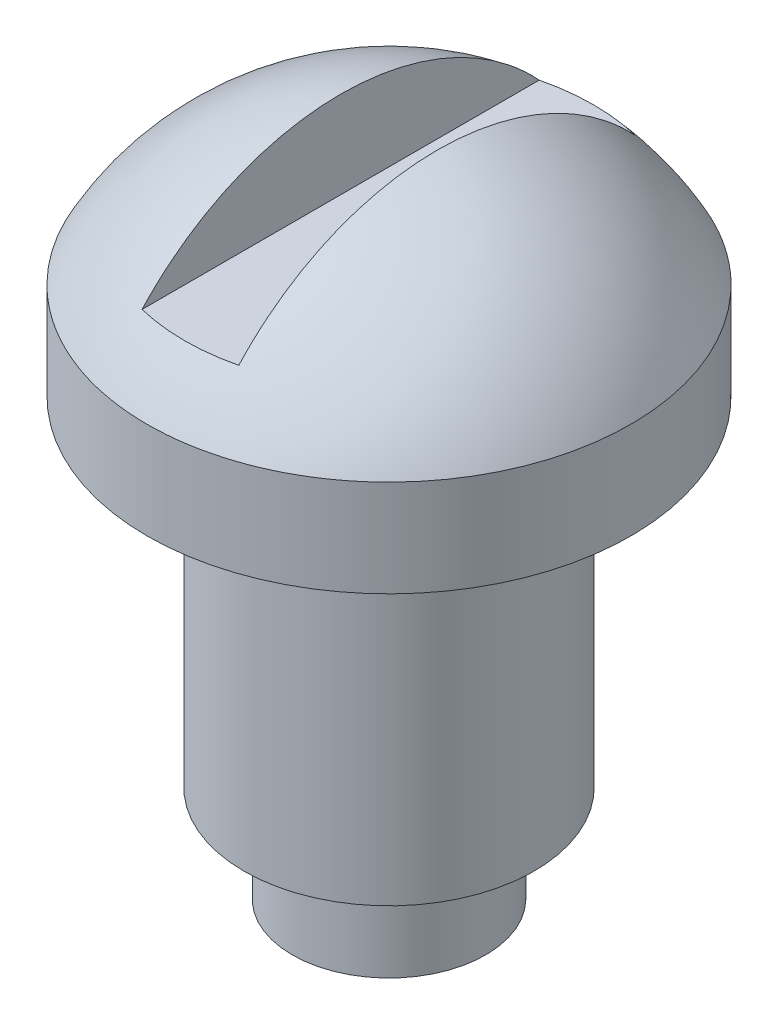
ISO-10303-21;
HEADER;
FILE_DESCRIPTION(('STEP AP214'),'2;1');
FILE_NAME('part.step','',(''),(''),'','','');
FILE_SCHEMA(('AUTOMOTIVE_DESIGN { 1 0 10303 214 1 1 1 1 }'));
ENDSEC;
DATA;
#1=APPLICATION_CONTEXT('core data for automotive mechanical design processes');
#2=APPLICATION_PROTOCOL_DEFINITION('international standard','automotive_design',2000,#1);
#3=PRODUCT_CONTEXT('',#1,'mechanical');
#4=PRODUCT('Part','Part','',(#3));
#5=PRODUCT_RELATED_PRODUCT_CATEGORY('part','',(#4));
#6=PRODUCT_DEFINITION_FORMATION('','',#4);
#7=PRODUCT_DEFINITION_CONTEXT('part definition',#1,'design');
#8=PRODUCT_DEFINITION('design','',#6,#7);
#9=PRODUCT_DEFINITION_SHAPE('','',#8);
#10=(LENGTH_UNIT() NAMED_UNIT(*) SI_UNIT(.MILLI.,.METRE.));
#11=(NAMED_UNIT(*) PLANE_ANGLE_UNIT() SI_UNIT($,.RADIAN.));
#12=(NAMED_UNIT(*) SI_UNIT($,.STERADIAN.) SOLID_ANGLE_UNIT());
#13=UNCERTAINTY_MEASURE_WITH_UNIT(LENGTH_MEASURE(1.E-05),#10,'distance_accuracy_value','');
#14=(GEOMETRIC_REPRESENTATION_CONTEXT(3) GLOBAL_UNCERTAINTY_ASSIGNED_CONTEXT((#13)) GLOBAL_UNIT_ASSIGNED_CONTEXT((#10,
#11,#12)) REPRESENTATION_CONTEXT('',''));
#15=CARTESIAN_POINT('',(0.,0.,0.));
#16=DIRECTION('',(0.,0.,1.));
#17=DIRECTION('',(1.,0.,0.));
#18=AXIS2_PLACEMENT_3D('',#15,#16,#17);
#19=CARTESIAN_POINT('',(0.,0.,0.));
#20=DIRECTION('',(0.,1.,0.));
#21=DIRECTION('',(0.,0.,1.));
#22=AXIS2_PLACEMENT_3D('',#19,#20,#21);
#23=PLANE('',#22);
#24=CARTESIAN_POINT('',(0.,0.,0.));
#25=DIRECTION('',(0.,1.,0.));
#26=DIRECTION('',(0.,0.,1.));
#27=AXIS2_PLACEMENT_3D('',#24,#25,#26);
#28=CIRCLE('',#27,2.);
#29=CARTESIAN_POINT('',(0.,0.,2.));
#30=VERTEX_POINT('',#29);
#31=EDGE_CURVE('E64',#30,#30,#28,.T.);
#32=ORIENTED_EDGE('',*,*,#31,.F.);
#33=EDGE_LOOP('',(#32));
#34=FACE_BOUND('',#33,.T.);
#35=ADVANCED_FACE('F32',(#34),#23,.F.);
#36=CARTESIAN_POINT('',(0.,0.,0.));
#37=DIRECTION('',(0.,1.,0.));
#38=DIRECTION('',(0.,0.,1.));
#39=AXIS2_PLACEMENT_3D('',#36,#37,#38);
#40=CYLINDRICAL_SURFACE('',#39,2.);
#41=CARTESIAN_POINT('',(0.,2.,0.));
#42=DIRECTION('',(0.,1.,0.));
#43=DIRECTION('',(0.,0.,1.));
#44=AXIS2_PLACEMENT_3D('',#41,#42,#43);
#45=CIRCLE('',#44,2.);
#46=CARTESIAN_POINT('',(0.,2.,2.));
#47=VERTEX_POINT('',#46);
#48=EDGE_CURVE('E77',#47,#47,#45,.T.);
#49=ORIENTED_EDGE('',*,*,#48,.F.);
#50=EDGE_LOOP('',(#49));
#51=FACE_BOUND('',#50,.T.);
#52=ORIENTED_EDGE('',*,*,#31,.T.);
#53=EDGE_LOOP('',(#52));
#54=FACE_BOUND('',#53,.T.);
#55=ADVANCED_FACE('F101',(#51,#54),#40,.T.);
#56=CARTESIAN_POINT('',(2.,2.,0.));
#57=DIRECTION('',(0.,1.,0.));
#58=DIRECTION('',(0.,0.,1.));
#59=AXIS2_PLACEMENT_3D('',#56,#57,#58);
#60=PLANE('',#59);
#61=CARTESIAN_POINT('',(0.,2.,0.));
#62=DIRECTION('',(0.,1.,0.));
#63=DIRECTION('',(0.,0.,1.));
#64=AXIS2_PLACEMENT_3D('',#61,#62,#63);
#65=CIRCLE('',#64,3.);
#66=CARTESIAN_POINT('',(0.,2.,3.));
#67=VERTEX_POINT('',#66);
#68=EDGE_CURVE('E80',#67,#67,#65,.T.);
#69=ORIENTED_EDGE('',*,*,#68,.F.);
#70=EDGE_LOOP('',(#69));
#71=FACE_BOUND('',#70,.T.);
#72=ORIENTED_EDGE('',*,*,#48,.T.);
#73=EDGE_LOOP('',(#72));
#74=FACE_BOUND('',#73,.T.);
#75=ADVANCED_FACE('F106',(#71,#74),#60,.F.);
#76=CARTESIAN_POINT('',(0.,0.,0.));
#77=DIRECTION('',(0.,1.,0.));
#78=DIRECTION('',(0.,0.,1.));
#79=AXIS2_PLACEMENT_3D('',#76,#77,#78);
#80=CYLINDRICAL_SURFACE('',#79,3.);
#81=CARTESIAN_POINT('',(0.,9.,0.));
#82=DIRECTION('',(0.,1.,0.));
#83=DIRECTION('',(0.,0.,1.));
#84=AXIS2_PLACEMENT_3D('',#81,#82,#83);
#85=CIRCLE('',#84,3.);
#86=CARTESIAN_POINT('',(0.,9.,3.));
#87=VERTEX_POINT('',#86);
#88=EDGE_CURVE('E83',#87,#87,#85,.T.);
#89=ORIENTED_EDGE('',*,*,#88,.F.);
#90=EDGE_LOOP('',(#89));
#91=FACE_BOUND('',#90,.T.);
#92=ORIENTED_EDGE('',*,*,#68,.T.);
#93=EDGE_LOOP('',(#92));
#94=FACE_BOUND('',#93,.T.);
#95=ADVANCED_FACE('F113',(#91,#94),#80,.T.);
#96=CARTESIAN_POINT('',(3.,9.,0.));
#97=DIRECTION('',(0.,1.,0.));
#98=DIRECTION('',(0.,0.,1.));
#99=AXIS2_PLACEMENT_3D('',#96,#97,#98);
#100=PLANE('',#99);
#101=CARTESIAN_POINT('',(0.,9.,0.));
#102=DIRECTION('',(0.,1.,0.));
#103=DIRECTION('',(0.,0.,1.));
#104=AXIS2_PLACEMENT_3D('',#101,#102,#103);
#105=CIRCLE('',#104,5.);
#106=CARTESIAN_POINT('',(0.,9.,5.));
#107=VERTEX_POINT('',#106);
#108=EDGE_CURVE('E74',#107,#107,#105,.T.);
#109=ORIENTED_EDGE('',*,*,#108,.F.);
#110=EDGE_LOOP('',(#109));
#111=FACE_BOUND('',#110,.T.);
#112=ORIENTED_EDGE('',*,*,#88,.T.);
#113=EDGE_LOOP('',(#112));
#114=FACE_BOUND('',#113,.T.);
#115=ADVANCED_FACE('F117',(#111,#114),#100,.F.);
#116=CARTESIAN_POINT('',(0.,0.,0.));
#117=DIRECTION('',(0.,1.,0.));
#118=DIRECTION('',(0.,0.,1.));
#119=AXIS2_PLACEMENT_3D('',#116,#117,#118);
#120=CYLINDRICAL_SURFACE('',#119,5.);
#121=CARTESIAN_POINT('',(0.,11.,0.));
#122=DIRECTION('',(0.,1.,0.));
#123=DIRECTION('',(0.,0.,1.));
#124=AXIS2_PLACEMENT_3D('',#121,#122,#123);
#125=CIRCLE('',#124,5.);
#126=CARTESIAN_POINT('',(0.,11.,5.));
#127=VERTEX_POINT('',#126);
#128=EDGE_CURVE('E71',#127,#127,#125,.T.);
#129=ORIENTED_EDGE('',*,*,#128,.F.);
#130=EDGE_LOOP('',(#129));
#131=FACE_BOUND('',#130,.T.);
#132=ORIENTED_EDGE('',*,*,#108,.T.);
#133=EDGE_LOOP('',(#132));
#134=FACE_BOUND('',#133,.T.);
#135=ADVANCED_FACE('F97',(#131,#134),#120,.T.);
#136=CARTESIAN_POINT('',(0.,8.33333333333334,0.));
#137=DIRECTION('',(0.,0.,1.));
#138=DIRECTION('',(1.,0.,0.));
#139=AXIS2_PLACEMENT_3D('',#136,#137,#138);
#140=SPHERICAL_SURFACE('',#139,5.66666666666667);
#141=CARTESIAN_POINT('',(0.,12.1092589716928,0.));
#142=DIRECTION('',(0.,-1.,0.));
#143=DIRECTION('',(0.,0.,-1.));
#144=AXIS2_PLACEMENT_3D('',#141,#142,#143);
#145=CIRCLE('',#144,4.22533983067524);
#146=CARTESIAN_POINT('',(-1.,12.1092589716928,-4.10530104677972));
#147=VERTEX_POINT('',#146);
#148=CARTESIAN_POINT('',(1.,12.1092589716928,-4.10530104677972));
#149=VERTEX_POINT('',#148);
#150=EDGE_CURVE('E63',#147,#149,#145,.T.);
#151=ORIENTED_EDGE('',*,*,#150,.T.);
#152=CARTESIAN_POINT('',(1.,8.33333333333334,0.));
#153=DIRECTION('',(1.,0.,0.));
#154=DIRECTION('',(0.,1.,0.));
#155=AXIS2_PLACEMENT_3D('',#152,#153,#154);
#156=CIRCLE('',#155,5.57773351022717);
#157=CARTESIAN_POINT('',(1.,12.1092589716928,4.10530104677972));
#158=VERTEX_POINT('',#157);
#159=EDGE_CURVE('E11',#149,#158,#156,.T.);
#160=ORIENTED_EDGE('',*,*,#159,.T.);
#161=CARTESIAN_POINT('',(-1.,12.1092589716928,4.10530104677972));
#162=VERTEX_POINT('',#161);
#163=EDGE_CURVE('E40',#158,#162,#145,.T.);
#164=ORIENTED_EDGE('',*,*,#163,.T.);
#165=CARTESIAN_POINT('',(-1.,8.33333333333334,0.));
#166=DIRECTION('',(-1.,0.,0.));
#167=DIRECTION('',(0.,-1.,0.));
#168=AXIS2_PLACEMENT_3D('',#165,#166,#167);
#169=CIRCLE('',#168,5.57773351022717);
#170=EDGE_CURVE('E59',#162,#147,#169,.T.);
#171=ORIENTED_EDGE('',*,*,#170,.T.);
#172=EDGE_LOOP('',(#151,#160,#164,#171));
#173=FACE_BOUND('',#172,.T.);
#174=ORIENTED_EDGE('',*,*,#128,.T.);
#175=EDGE_LOOP('',(#174));
#176=FACE_BOUND('',#175,.T.);
#177=ADVANCED_FACE('F34',(#173,#176),#140,.T.);
#178=CARTESIAN_POINT('',(1.,16.1092589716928,-5.));
#179=DIRECTION('',(1.,0.,0.));
#180=DIRECTION('',(0.,1.,0.));
#181=AXIS2_PLACEMENT_3D('',#178,#179,#180);
#182=PLANE('',#181);
#183=DIRECTION('',(0.,0.,1.));
#184=VECTOR('',#183,1.);
#185=CARTESIAN_POINT('',(1.,12.1092589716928,-5.));
#186=LINE('',#185,#184);
#187=EDGE_CURVE('E67',#149,#158,#186,.T.);
#188=ORIENTED_EDGE('',*,*,#187,.T.);
#189=ORIENTED_EDGE('',*,*,#159,.F.);
#190=EDGE_LOOP('',(#188,#189));
#191=FACE_BOUND('',#190,.T.);
#192=ADVANCED_FACE('F89',(#191),#182,.F.);
#193=CARTESIAN_POINT('',(-1.,12.1092589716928,-5.));
#194=DIRECTION('',(0.,-1.,0.));
#195=DIRECTION('',(0.,0.,-1.));
#196=AXIS2_PLACEMENT_3D('',#193,#194,#195);
#197=PLANE('',#196);
#198=ORIENTED_EDGE('',*,*,#187,.F.);
#199=ORIENTED_EDGE('',*,*,#150,.F.);
#200=DIRECTION('',(0.,0.,1.));
#201=VECTOR('',#200,1.);
#202=CARTESIAN_POINT('',(-1.,12.1092589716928,-5.));
#203=LINE('',#202,#201);
#204=EDGE_CURVE('E46',#147,#162,#203,.T.);
#205=ORIENTED_EDGE('',*,*,#204,.T.);
#206=ORIENTED_EDGE('',*,*,#163,.F.);
#207=EDGE_LOOP('',(#198,#199,#205,#206));
#208=FACE_BOUND('',#207,.T.);
#209=ADVANCED_FACE('F66',(#208),#197,.F.);
#210=CARTESIAN_POINT('',(-1.,16.1092589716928,-5.));
#211=DIRECTION('',(-1.,0.,0.));
#212=DIRECTION('',(0.,-1.,0.));
#213=AXIS2_PLACEMENT_3D('',#210,#211,#212);
#214=PLANE('',#213);
#215=ORIENTED_EDGE('',*,*,#204,.F.);
#216=ORIENTED_EDGE('',*,*,#170,.F.);
#217=EDGE_LOOP('',(#215,#216));
#218=FACE_BOUND('',#217,.T.);
#219=ADVANCED_FACE('F60',(#218),#214,.F.);
#220=CLOSED_SHELL('',(#35,#55,#75,#95,#115,#135,#177,#192,#209,#219));
#221=MANIFOLD_SOLID_BREP('B2',#220);
#222=ADVANCED_BREP_SHAPE_REPRESENTATION('',(#18,#221),#14);
#223=SHAPE_DEFINITION_REPRESENTATION(#9,#222);
ENDSEC;
END-ISO-10303-21;
